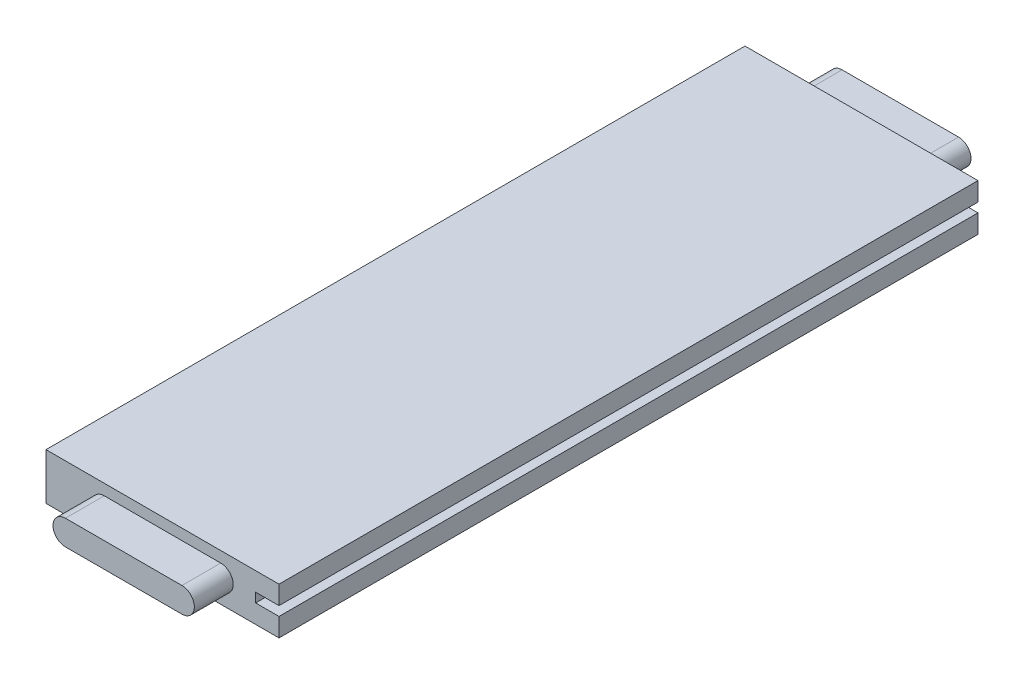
from build123d import *

# Parameters (mm, degrees)
CROQUIS1_W                      = 170
CROQUIS1_H                      = 35
EXTRUIR1_DEPTH                  = 275
CEPILLADO_REGRUESADO_DEPTH      = 289.368254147
CEPILLADO_REGRUESADO_DEPTH_BACK = 289.368254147
CROQUIS2_W                      = 150
CROQUIS2_H                      = 30
CROQUIS3_W                      = 150
CROQUIS3_H                      = 25
LARGO_CORTE_DEPTH               = 287.618212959
CROQUIS5_W                      = 15
CROQUIS5_H                      = 6
RANURADO_TUP_DEPTH              = 506.816172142
ESPIGA_DEPTH                    = 25


with BuildPart() as part:
    # Croquis1 → Extruir1 (new, symmetric)
    with BuildSketch(Plane.XY):
        Rectangle(CROQUIS1_W, CROQUIS1_H)
    extrude(amount=EXTRUIR1_DEPTH, both=True)

    # Croquis2 → Cepillado -Regruesado (cut, two sides: drawn at the far end of the back side and taken through both)
    with BuildSketch(Plane.XY.offset(-CEPILLADO_REGRUESADO_DEPTH_BACK)):
        Polygon((-85, 17.5), (85, 17.5), (85, 10), (85, -10), (85, -17.5), (-85, -17.5), (-85, -10), (-85, 10), align=None)
        Rectangle(CROQUIS2_W, CROQUIS2_H, mode=Mode.SUBTRACT)
    extrude(amount=CEPILLADO_REGRUESADO_DEPTH + CEPILLADO_REGRUESADO_DEPTH_BACK, mode=Mode.SUBTRACT)

    # Croquis3 → Largo - Corte (cut, through all)
    with BuildSketch(Plane(origin=(0, 15, 0), x_dir=(1, 0, 0), z_dir=(0, 1, 0))):
        with Locations((0, 262.5)):
            Rectangle(CROQUIS3_W, CROQUIS3_H)
        with Locations((0, -262.5)):
            Rectangle(CROQUIS3_W, CROQUIS3_H)
    extrude(amount=-LARGO_CORTE_DEPTH, mode=Mode.SUBTRACT)

    # Croquis5 → Ranurado - Tup (cut, through all)
    with BuildSketch(Plane(origin=(0, 0, -250), x_dir=(-1, 0, 0), z_dir=(0, 0, -1))):
        with Locations((-67.5, 0)):
            Rectangle(CROQUIS5_W, CROQUIS5_H)
    extrude(amount=-RANURADO_TUP_DEPTH, mode=Mode.SUBTRACT)

    # Croquis4 → Espiga (cut)
    with BuildSketch(Plane.XY.offset(250)):
        Polygon((75, 15), (-75, 15), (-75, -15), (75, -15), (75, -3), (60, -3), (60, 3), (75, 3), align=None)
        with BuildLine():
            Line((-37.5, 8), (37.5, 8))
            ThreePointArc((37.5, 8), (45.5, 0), (37.5, -8))
            Line((37.5, -8), (-37.5, -8))
            ThreePointArc((-37.5, -8), (-45.5, 0), (-37.5, 8))
        make_face(mode=Mode.SUBTRACT)
    espiga = extrude(amount=-ESPIGA_DEPTH, mode=Mode.SUBTRACT)

    # Simetr_a1: Espiga across plane
    add(espiga.mirror(Plane.XY), mode=Mode.SUBTRACT)


solid = part.part
